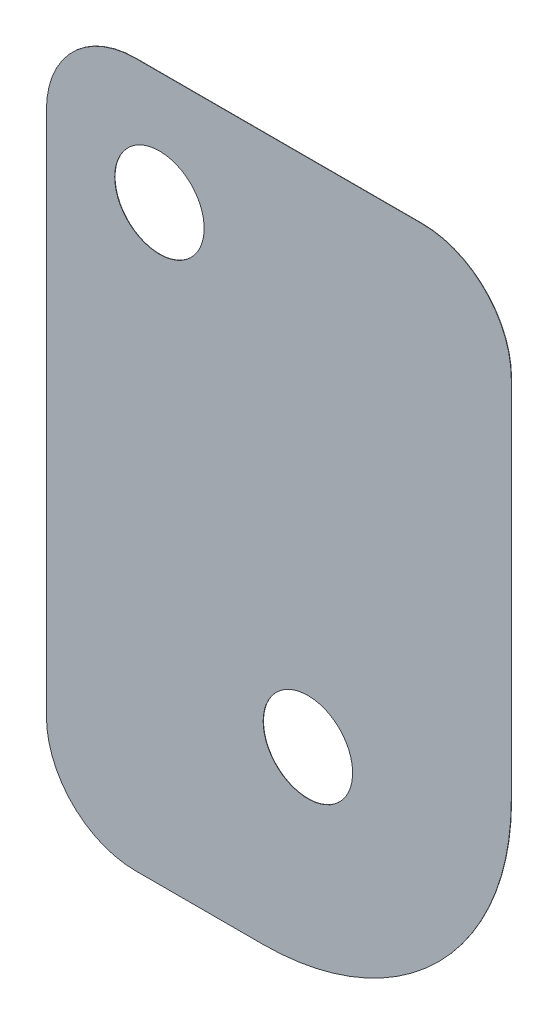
from build123d import *

# Parameters (mm, degrees)
BOSS_EXTRUDE1_DEPTH = 0.0254
HOLE1_D             = 7.1374
HOLE12_D            = 7.1374


with BuildPart() as part:
    # Sketch2 → Boss-Extrude1 (new body)
    with BuildSketch(Plane(origin=(0, 0, 15.8746), x_dir=(-1, 0, 0), z_dir=(0, 0, -1))):
        with BuildLine():
            Line((536.321, 9.704159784), (513.461, 9.704159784))
            ThreePointArc((513.461, 9.704159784), (508.432056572, 7.621103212), (506.349, 2.592159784))
            Line((506.349, 2.592159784), (506.349, -26.617840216))
            ThreePointArc((506.349, -26.617840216), (512.151800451, -40.627039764), (526.161, -46.429840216))
            Line((526.161, -46.429840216), (536.321, -46.429840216))
            ThreePointArc((536.321, -46.429840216), (541.349943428, -44.346783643), (543.433, -39.317840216))
            Line((543.433, -39.317840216), (543.433, 2.592159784))
            ThreePointArc((543.433, 2.592159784), (541.349943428, 7.621103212), (536.321, 9.704159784))
        make_face()
    extrude(amount=-BOSS_EXTRUDE1_DEPTH)

    # Hole1 (through all)
    with Locations(Plane(origin=(-518.918535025, -20.035039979, 15.8746), x_dir=(-1, 0, 0), z_dir=(0, 0, -1))):
        with Locations((3.654260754, -10.973552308), (15.497464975, 20.722199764)):
            Hole(HOLE1_D / 2)

    # Hole12 (through all)
    with Locations(Plane(origin=(-530.761739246, 11.288300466, 15.8746), x_dir=(-1, 0, 0), z_dir=(0, 0, -1))):
        with Locations((3.654260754, -10.601140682), (-8.188943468, -42.296892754)):
            Hole(HOLE12_D / 2)


solid = part.part
